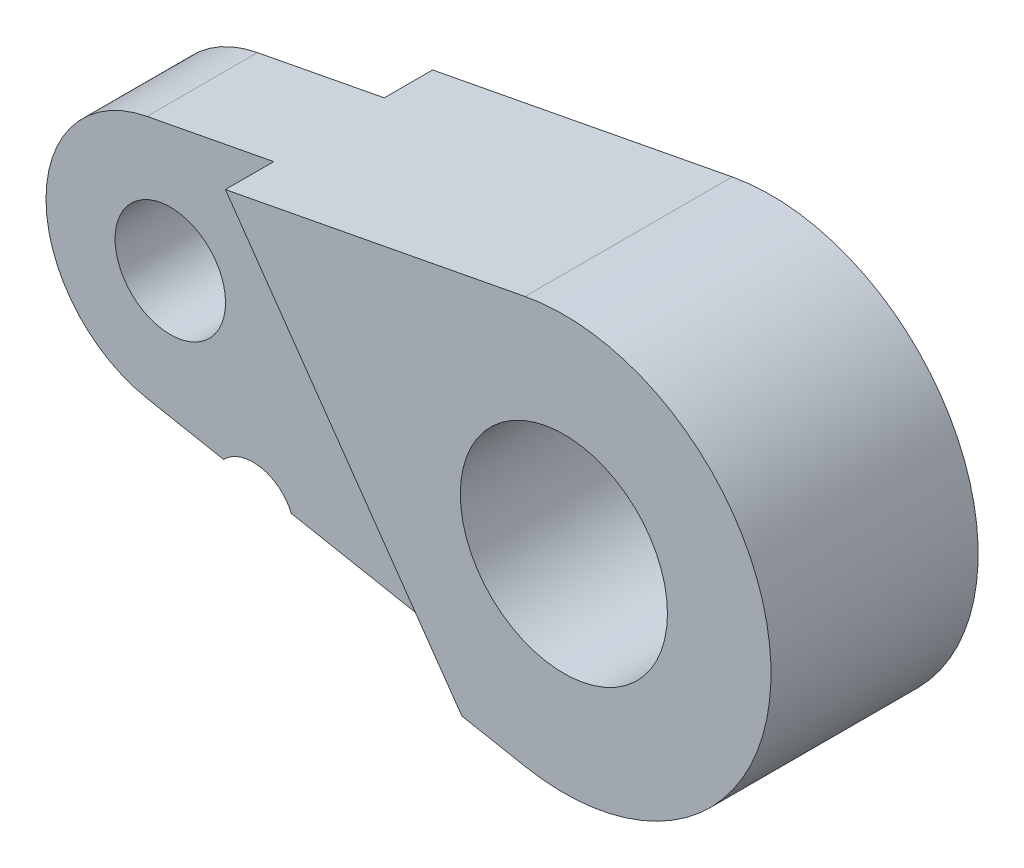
from build123d import *

# Parameters (mm, degrees)
EXTRUSION1_DEPTH             = 7.5
ENL_V_MAT_EXTRU_1_DEPTH      = 3.5
ESQUISSE3_R                  = 7.5
ESQUISSE3_R_2                = 4
ENL_V_MAT_EXTRU_2_DEPTH      = 47.16275555
ENL_V_MAT_EXTRU_3_DEPTH      = 45.297291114
ENL_V_MAT_EXTRU_3_DEPTH_BACK = 45.297291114
ESQUISSE4_R                  = 3


with BuildPart() as part:
    # Esquisse1 → Extrusion1 (new, symmetric)
    with BuildSketch(Plane.XY):
        with BuildLine():
            Line((-33.6875, 8.840381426), (-2.8125, 14.733969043))
            ThreePointArc((-2.8125, 14.733969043), (15, 0), (-2.8125, -14.733969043))
            Line((-2.8125, -14.733969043), (-33.6875, -8.840381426))
            ThreePointArc((-33.6875, -8.840381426), (-41, 0), (-33.6875, 8.840381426))
        make_face()
    extrude(amount=EXTRUSION1_DEPTH, both=True)

    # Esquisse2 → Enl_v. mat.-Extru.1 (cut)
    with BuildSketch(Plane.XY.offset(7.5)):
        with BuildLine():
            Line((-24.507887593, 10.592635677), (-33.6875, 8.840381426))
            ThreePointArc((-33.6875, 8.840381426), (-41, 0), (-33.6875, -8.840381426))
            Line((-33.6875, -8.840381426), (-7.385191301, -13.861108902))
            Line((-7.385191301, -13.861108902), (-24.507887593, 10.592635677))
        make_face()
    enl_v_mat_extru_1 = extrude(amount=-ENL_V_MAT_EXTRU_1_DEPTH, mode=Mode.SUBTRACT)

    # Sym_trie1: Enl_v. mat.-Extru.1 across plane
    add(enl_v_mat_extru_1.mirror(Plane.XY), mode=Mode.SUBTRACT)

    # Esquisse3 → Enl_v. mat.-Extru.2 (cut, through all)
    with BuildSketch(Plane.XY.offset(7.5)):
        Circle(ESQUISSE3_R)
        with Locations((-32, 0)):
            Circle(ESQUISSE3_R_2)
    extrude(amount=-ENL_V_MAT_EXTRU_2_DEPTH, mode=Mode.SUBTRACT)

    # Esquisse4 → Enl_v. mat.-Extru.3 (cut, two sides: drawn at the far end of the back side and taken through both)
    with BuildSketch(Plane.XY.offset(-ENL_V_MAT_EXTRU_3_DEPTH_BACK)):
        with Locations((-26, -12)):
            Circle(ESQUISSE4_R)
    extrude(amount=ENL_V_MAT_EXTRU_3_DEPTH + ENL_V_MAT_EXTRU_3_DEPTH_BACK, mode=Mode.SUBTRACT)


solid = part.part
